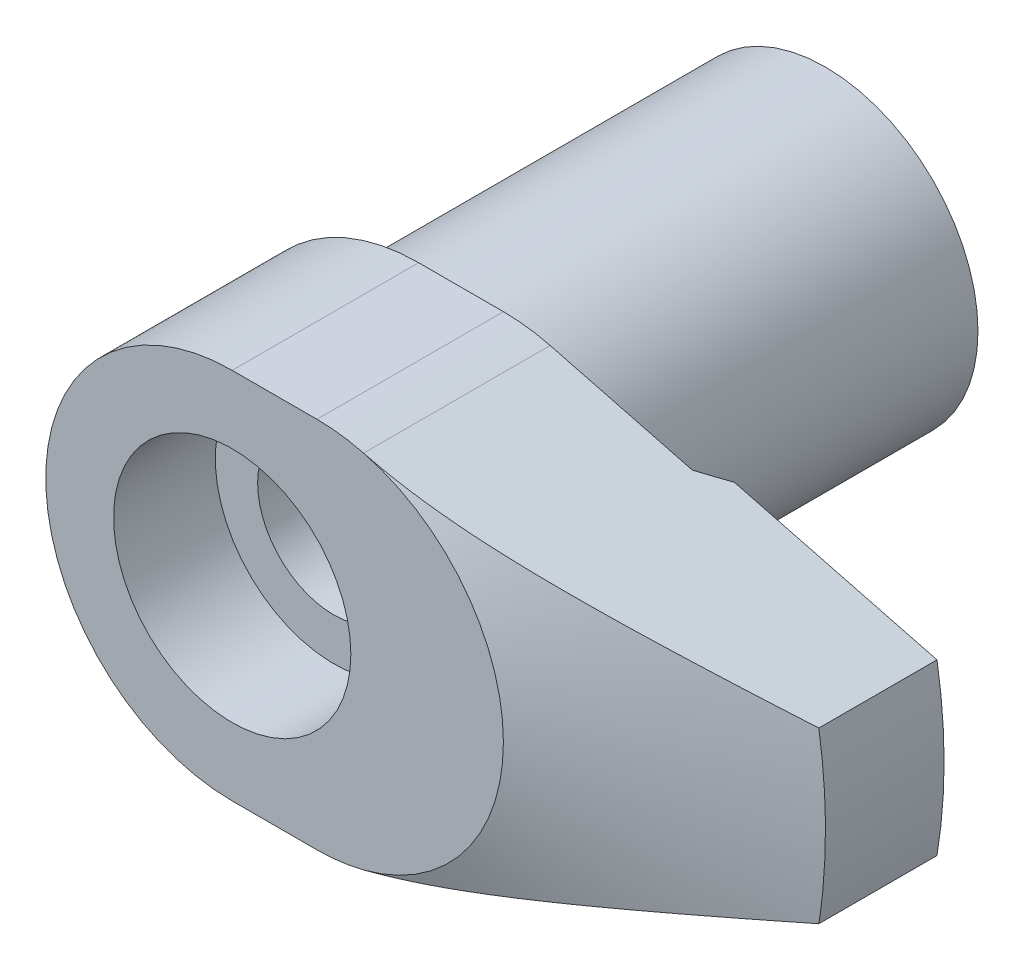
ISO-10303-21;
HEADER;
FILE_DESCRIPTION(('STEP AP214'),'2;1');
FILE_NAME('part.step','',(''),(''),'','','');
FILE_SCHEMA(('AUTOMOTIVE_DESIGN { 1 0 10303 214 1 1 1 1 }'));
ENDSEC;
DATA;
#1=APPLICATION_CONTEXT('core data for automotive mechanical design processes');
#2=APPLICATION_PROTOCOL_DEFINITION('international standard','automotive_design',2000,#1);
#3=PRODUCT_CONTEXT('',#1,'mechanical');
#4=PRODUCT('Part','Part','',(#3));
#5=PRODUCT_RELATED_PRODUCT_CATEGORY('part','',(#4));
#6=PRODUCT_DEFINITION_FORMATION('','',#4);
#7=PRODUCT_DEFINITION_CONTEXT('part definition',#1,'design');
#8=PRODUCT_DEFINITION('design','',#6,#7);
#9=PRODUCT_DEFINITION_SHAPE('','',#8);
#10=(LENGTH_UNIT() NAMED_UNIT(*) SI_UNIT(.MILLI.,.METRE.));
#11=(NAMED_UNIT(*) PLANE_ANGLE_UNIT() SI_UNIT($,.RADIAN.));
#12=(NAMED_UNIT(*) SI_UNIT($,.STERADIAN.) SOLID_ANGLE_UNIT());
#13=UNCERTAINTY_MEASURE_WITH_UNIT(LENGTH_MEASURE(1.E-05),#10,'distance_accuracy_value','');
#14=(GEOMETRIC_REPRESENTATION_CONTEXT(3) GLOBAL_UNCERTAINTY_ASSIGNED_CONTEXT((#13)) GLOBAL_UNIT_ASSIGNED_CONTEXT((#10,
#11,#12)) REPRESENTATION_CONTEXT('',''));
#15=CARTESIAN_POINT('',(0.,0.,0.));
#16=DIRECTION('',(0.,0.,1.));
#17=DIRECTION('',(1.,0.,0.));
#18=AXIS2_PLACEMENT_3D('',#15,#16,#17);
#19=CARTESIAN_POINT('',(29.5803989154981,5.,23.));
#20=DIRECTION('',(0.250587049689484,0.968094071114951,0.));
#21=DIRECTION('',(-0.968094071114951,0.250587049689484,0.));
#22=AXIS2_PLACEMENT_3D('',#19,#20,#21);
#23=PLANE('',#22);
#24=CARTESIAN_POINT('',(27.4352162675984,5.55527144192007,14.8872336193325));
#25=CARTESIAN_POINT('',(27.1469393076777,5.62989071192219,15.1491153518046));
#26=CARTESIAN_POINT('',(26.8580444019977,5.70466993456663,15.4102731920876));
#27=CARTESIAN_POINT('',(26.2788498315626,5.85459199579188,15.9309294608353));
#28=CARTESIAN_POINT('',(25.9885501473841,5.92973483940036,16.1904278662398));
#29=CARTESIAN_POINT('',(25.40625994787,6.08045819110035,16.7076575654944));
#30=CARTESIAN_POINT('',(25.1142687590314,6.15603887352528,16.9653880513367));
#31=CARTESIAN_POINT('',(24.5285196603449,6.30765754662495,17.4786929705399));
#32=CARTESIAN_POINT('',(24.234761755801,6.38369553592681,17.734267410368));
#33=CARTESIAN_POINT('',(23.3389665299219,6.61556833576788,18.5072735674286));
#34=CARTESIAN_POINT('',(22.7337827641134,6.77221759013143,19.0208431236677));
#35=CARTESIAN_POINT('',(21.8180133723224,7.00926061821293,19.7807704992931));
#36=CARTESIAN_POINT('',(21.5114579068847,7.08861120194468,20.0323153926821));
#37=CARTESIAN_POINT('',(20.8952465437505,7.24811490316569,20.5313161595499));
#38=CARTESIAN_POINT('',(20.5855907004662,7.32826800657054,20.7787721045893));
#39=CARTESIAN_POINT('',(19.9624238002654,7.48957211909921,21.2690618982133));
#40=CARTESIAN_POINT('',(19.6489095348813,7.57072395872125,21.5118914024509));
#41=CARTESIAN_POINT('',(19.0177283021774,7.73410254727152,21.9917420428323));
#42=CARTESIAN_POINT('',(18.7000612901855,7.81632930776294,22.2287631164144));
#43=CARTESIAN_POINT('',(18.059644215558,7.98209855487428,22.695970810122));
#44=CARTESIAN_POINT('',(17.7368901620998,8.06564207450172,22.9261516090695));
#45=CARTESIAN_POINT('',(17.0857762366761,8.23418015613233,23.3779063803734));
#46=CARTESIAN_POINT('',(16.7574164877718,8.31917468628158,23.5994805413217));
#47=CARTESIAN_POINT('',(16.0961063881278,8.49035200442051,24.0307522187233));
#48=CARTESIAN_POINT('',(15.7631938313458,8.57652500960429,24.2405113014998));
#49=CARTESIAN_POINT('',(15.0898925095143,8.75080620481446,24.6469894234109));
#50=CARTESIAN_POINT('',(14.7495028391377,8.83891462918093,24.8437068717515));
#51=CARTESIAN_POINT('',(14.0607320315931,9.01720003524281,25.2204922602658));
#52=CARTESIAN_POINT('',(13.7123625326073,9.10737400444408,25.4005827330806));
#53=CARTESIAN_POINT('',(13.0063877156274,9.29011259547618,25.7401308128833));
#54=CARTESIAN_POINT('',(12.6487859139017,9.38267630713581,25.8995961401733));
#55=CARTESIAN_POINT('',(11.9176536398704,9.57192679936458,26.1952138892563));
#56=CARTESIAN_POINT('',(11.5439568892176,9.66865662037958,26.3309325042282));
#57=CARTESIAN_POINT('',(10.7866333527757,9.86468660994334,26.5693931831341));
#58=CARTESIAN_POINT('',(10.4030079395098,9.96398642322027,26.6721397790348));
#59=CARTESIAN_POINT('',(9.82318396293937,10.1140714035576,26.7964437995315));
#60=CARTESIAN_POINT('',(9.62990718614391,10.1641002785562,26.832828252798));
#61=CARTESIAN_POINT('',(9.24180831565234,10.2645580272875,26.8952742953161));
#62=CARTESIAN_POINT('',(9.04698647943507,10.3149868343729,26.9213375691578));
#63=CARTESIAN_POINT('',(8.65628411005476,10.4161184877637,26.9626251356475));
#64=CARTESIAN_POINT('',(8.46040367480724,10.4668213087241,26.9778504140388));
#65=CARTESIAN_POINT('',(8.06812506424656,10.5683609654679,26.9971505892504));
#66=CARTESIAN_POINT('',(7.87172688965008,10.6191978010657,27.0012255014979));
#67=CARTESIAN_POINT('',(7.47834221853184,10.7210237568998,26.9981314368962));
#68=CARTESIAN_POINT('',(7.28135600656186,10.772012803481,26.9909239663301));
#69=CARTESIAN_POINT('',(6.88806770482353,10.8738138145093,26.9653489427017));
#70=CARTESIAN_POINT('',(6.69176561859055,10.9246257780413,26.9469813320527));
#71=CARTESIAN_POINT('',(6.30036520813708,11.0259381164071,26.8994613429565));
#72=CARTESIAN_POINT('',(6.10526705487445,11.0764384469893,26.8703074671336));
#73=CARTESIAN_POINT('',(5.71674773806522,11.177005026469,26.8017843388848));
#74=CARTESIAN_POINT('',(5.52332685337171,11.2270712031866,26.7624134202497));
#75=CARTESIAN_POINT('',(4.94179129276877,11.3775992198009,26.6289953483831));
#76=CARTESIAN_POINT('',(4.55679436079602,11.4772540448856,26.5202003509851));
#77=CARTESIAN_POINT('',(3.79703012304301,11.6739157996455,26.2701775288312));
#78=CARTESIAN_POINT('',(3.42226333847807,11.7709225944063,26.1289480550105));
#79=CARTESIAN_POINT('',(2.7532517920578,11.9440933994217,25.84972275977));
#80=CARTESIAN_POINT('',(2.45723011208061,12.0207173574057,25.7162053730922));
#81=CARTESIAN_POINT('',(1.87162827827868,12.1722979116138,25.4349750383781));
#82=CARTESIAN_POINT('',(1.58204774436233,12.247254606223,25.2872629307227));
#83=CARTESIAN_POINT('',(1.01474960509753,12.3940973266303,24.9833062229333));
#84=CARTESIAN_POINT('',(0.736910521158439,12.466014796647,24.827301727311));
#85=CARTESIAN_POINT('',(0.186515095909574,12.6084823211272,24.5059660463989));
#86=CARTESIAN_POINT('',(-0.086043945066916,12.679033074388,24.3406398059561));
#87=CARTESIAN_POINT('',(-0.356308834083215,12.7489899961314,24.171522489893));
#88=B_SPLINE_CURVE_WITH_KNOTS('',3,(#24,#25,#26,#27,#28,#29,#30,#31,#32,#33,#34,#35,#36,#37,#38,
#39,#40,#41,#42,#43,#44,#45,#46,#47,#48,#49,#50,#51,#52,#53,#54,#55,#56,#57,#58,#59,#60,#61,#62,
#63,#64,#65,#66,#67,#68,#69,#70,#71,#72,#73,#74,#75,#76,#77,#78,#79,#80,#81,#82,#83,#84,#85,#86,
#87),.UNSPECIFIED.,.F.,.F.,(4,2,2,2,2,2,2,2,2,2,2,2,2,2,2,2,2,2,2,2,2,2,2,2,2,2,2,2,2,2,2,4),
(0.,1.1896572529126,2.37933100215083,3.56951641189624,4.75969825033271,7.18662885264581,
8.39983408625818,9.61301806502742,10.8272900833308,12.0415751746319,13.2568656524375,
14.4721294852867,15.6803270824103,16.8886717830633,18.0953541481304,19.3015835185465,
20.5279572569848,21.7541623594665,22.3627422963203,22.9712228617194,23.5796480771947,
24.1880724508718,24.7985772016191,25.4090851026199,26.0196777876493,26.6303701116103,
27.8654022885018,29.1004972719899,30.1010602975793,31.1015641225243,32.0813446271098,
33.0606101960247),.UNSPECIFIED.);
#89=CARTESIAN_POINT('',(17.6291186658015,8.09353826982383,23.));
#90=VERTEX_POINT('',#89);
#91=CARTESIAN_POINT('',(16.1403981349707,8.47888727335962,24.));
#92=VERTEX_POINT('',#91);
#93=EDGE_CURVE('E172',#90,#92,#88,.T.);
#94=ORIENTED_EDGE('',*,*,#93,.T.);
#95=DIRECTION('',(0.968094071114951,-0.250587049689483,0.));
#96=VECTOR('',#95,1.);
#97=CARTESIAN_POINT('',(7.75645754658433,10.6490347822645,24.));
#98=LINE('',#97,#96);
#99=CARTESIAN_POINT('',(7.75645754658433,10.6490347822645,24.));
#100=VERTEX_POINT('',#99);
#101=EDGE_CURVE('E272',#100,#92,#98,.T.);
#102=ORIENTED_EDGE('',*,*,#101,.F.);
#103=DIRECTION('',(0.,0.,1.));
#104=VECTOR('',#103,1.);
#105=CARTESIAN_POINT('',(7.75645754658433,10.6490347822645,23.));
#106=LINE('',#105,#104);
#107=CARTESIAN_POINT('',(7.75645754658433,10.6490347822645,35.));
#108=VERTEX_POINT('',#107);
#109=EDGE_CURVE('E247',#100,#108,#106,.T.);
#110=ORIENTED_EDGE('',*,*,#109,.T.);
#111=CARTESIAN_POINT('',(29.5805989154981,4.99994823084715,29.9700123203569));
#112=CARTESIAN_POINT('',(29.1357626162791,5.11509222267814,30.1174860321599));
#113=CARTESIAN_POINT('',(28.6906869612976,5.23029817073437,30.2641938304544));
#114=CARTESIAN_POINT('',(27.7999660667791,5.46085750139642,30.5557686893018));
#115=CARTESIAN_POINT('',(27.3543208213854,5.57621088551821,30.7006357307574));
#116=CARTESIAN_POINT('',(26.4624675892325,5.80706331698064,30.9881885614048));
#117=CARTESIAN_POINT('',(26.0162597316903,5.92256233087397,31.1308747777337));
#118=CARTESIAN_POINT('',(25.1230866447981,6.15375640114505,31.4136944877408));
#119=CARTESIAN_POINT('',(24.6761214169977,6.26945145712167,31.5538279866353));
#120=CARTESIAN_POINT('',(23.7834718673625,6.50051001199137,31.8303799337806));
#121=CARTESIAN_POINT('',(23.3377918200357,6.61587240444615,31.9668130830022));
#122=CARTESIAN_POINT('',(22.4454084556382,6.84686205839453,32.2360589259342));
#123=CARTESIAN_POINT('',(21.9987051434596,6.96248931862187,32.3688716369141));
#124=CARTESIAN_POINT('',(21.103931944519,7.19409757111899,32.6301684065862));
#125=CARTESIAN_POINT('',(20.6558616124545,7.31007867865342,32.7586508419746));
#126=CARTESIAN_POINT('',(19.7583140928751,7.54240505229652,33.0102832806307));
#127=CARTESIAN_POINT('',(19.3088369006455,7.65875031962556,33.1334332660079));
#128=CARTESIAN_POINT('',(18.4054157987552,7.89259704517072,33.3739579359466));
#129=CARTESIAN_POINT('',(17.9514615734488,8.01010117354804,33.4912914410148));
#130=CARTESIAN_POINT('',(17.0416464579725,8.24560296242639,33.7178219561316));
#131=CARTESIAN_POINT('',(16.5857855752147,8.36360062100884,33.8270189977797));
#132=CARTESIAN_POINT('',(15.672322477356,8.60004667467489,34.0352992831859));
#133=CARTESIAN_POINT('',(15.2147222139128,8.71849456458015,34.1343915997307));
#134=CARTESIAN_POINT('',(14.297156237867,8.9560026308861,34.3203168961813));
#135=CARTESIAN_POINT('',(13.8371904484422,9.0750628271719,34.4071494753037));
#136=CARTESIAN_POINT('',(12.9125012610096,9.31441470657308,34.5663560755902));
#137=CARTESIAN_POINT('',(12.4477655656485,9.43470957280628,34.638654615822));
#138=CARTESIAN_POINT('',(11.5160403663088,9.67588269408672,34.7654169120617));
#139=CARTESIAN_POINT('',(11.0490512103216,9.79676085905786,34.8198833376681));
#140=CARTESIAN_POINT('',(10.3464754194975,9.978619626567,34.8863416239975));
#141=CARTESIAN_POINT('',(10.111552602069,10.0394284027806,34.9059735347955));
#142=CARTESIAN_POINT('',(9.64134067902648,10.1611407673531,34.939841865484));
#143=CARTESIAN_POINT('',(9.40605157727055,10.2220443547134,34.9540783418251));
#144=CARTESIAN_POINT('',(8.93508346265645,10.3439524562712,34.9769487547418));
#145=CARTESIAN_POINT('',(8.69940430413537,10.4049570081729,34.9855794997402));
#146=CARTESIAN_POINT('',(8.2279035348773,10.5270029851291,34.9971137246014));
#147=CARTESIAN_POINT('',(7.99208191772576,10.5880444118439,35.0000169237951));
#148=CARTESIAN_POINT('',(7.75625754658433,10.6490865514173,34.9999999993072));
#149=B_SPLINE_CURVE_WITH_KNOTS('',3,(#111,#112,#113,#114,#115,#116,#117,#118,#119,#120,#121,
#122,#123,#124,#125,#126,#127,#128,#129,#130,#131,#132,#133,#134,#135,#136,#137,#138,#139,#140,
#141,#142,#143,#144,#145,#146,#147,#148),.UNSPECIFIED.,.F.,.F.,(4,2,2,2,2,2,2,2,2,2,2,2,2,2,2,2,
2,2,4),(0.,1.44774916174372,2.89551333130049,4.34299021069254,5.79046413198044,7.23093053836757,
8.67139007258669,10.1123837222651,11.5533822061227,13.0034407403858,14.4534936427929,
15.9022328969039,17.3510195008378,18.8071461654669,20.2630547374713,20.9933787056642,
21.7236950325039,22.4544267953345,23.1851943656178),.UNSPECIFIED.);
#150=CARTESIAN_POINT('',(29.5803989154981,5.,29.9700786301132));
#151=VERTEX_POINT('',#150);
#152=EDGE_CURVE('E163',#151,#108,#149,.T.);
#153=ORIENTED_EDGE('',*,*,#152,.F.);
#154=DIRECTION('',(0.,0.,1.));
#155=VECTOR('',#154,1.);
#156=CARTESIAN_POINT('',(29.5803989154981,5.,23.));
#157=LINE('',#156,#155);
#158=CARTESIAN_POINT('',(29.5803989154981,5.,23.));
#159=VERTEX_POINT('',#158);
#160=EDGE_CURVE('E43',#159,#151,#157,.T.);
#161=ORIENTED_EDGE('',*,*,#160,.F.);
#162=DIRECTION('',(-0.968094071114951,0.250587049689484,0.));
#163=VECTOR('',#162,1.);
#164=CARTESIAN_POINT('',(29.5803989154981,5.,23.));
#165=LINE('',#164,#163);
#166=EDGE_CURVE('E234',#159,#90,#165,.T.);
#167=ORIENTED_EDGE('',*,*,#166,.T.);
#168=EDGE_LOOP('',(#94,#102,#110,#153,#161,#167));
#169=FACE_BOUND('',#168,.T.);
#170=ADVANCED_FACE('F14',(#169),#23,.T.);
#171=CARTESIAN_POINT('',(29.5803989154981,-5.,23.));
#172=DIRECTION('',(0.250587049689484,-0.968094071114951,0.));
#173=DIRECTION('',(0.968094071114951,0.250587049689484,0.));
#174=AXIS2_PLACEMENT_3D('',#171,#172,#173);
#175=PLANE('',#174);
#176=DIRECTION('',(0.,0.,1.));
#177=VECTOR('',#176,1.);
#178=CARTESIAN_POINT('',(7.75645754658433,-10.6490347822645,23.));
#179=LINE('',#178,#177);
#180=CARTESIAN_POINT('',(7.75645754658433,-10.6490347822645,24.));
#181=VERTEX_POINT('',#180);
#182=CARTESIAN_POINT('',(7.75645754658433,-10.6490347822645,35.));
#183=VERTEX_POINT('',#182);
#184=EDGE_CURVE('E235',#181,#183,#179,.T.);
#185=ORIENTED_EDGE('',*,*,#184,.F.);
#186=DIRECTION('',(-0.968094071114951,-0.250587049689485,0.));
#187=VECTOR('',#186,1.);
#188=CARTESIAN_POINT('',(16.1403981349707,-8.47888727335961,24.));
#189=LINE('',#188,#187);
#190=CARTESIAN_POINT('',(16.1403981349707,-8.47888727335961,24.));
#191=VERTEX_POINT('',#190);
#192=EDGE_CURVE('E283',#191,#181,#189,.T.);
#193=ORIENTED_EDGE('',*,*,#192,.F.);
#194=CARTESIAN_POINT('',(-0.356308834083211,-12.7489899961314,24.171522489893));
#195=CARTESIAN_POINT('',(-0.159761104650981,-12.6981144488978,24.2945403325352));
#196=CARTESIAN_POINT('',(0.0379983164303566,-12.6469252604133,24.4155205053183));
#197=CARTESIAN_POINT('',(0.436199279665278,-12.5438526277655,24.6527843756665));
#198=CARTESIAN_POINT('',(0.636641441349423,-12.4919690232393,24.7690669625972));
#199=CARTESIAN_POINT('',(1.04115426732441,-12.3872625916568,24.9966949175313));
#200=CARTESIAN_POINT('',(1.24523595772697,-12.3344369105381,25.1080194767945));
#201=CARTESIAN_POINT('',(1.65644867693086,-12.2279962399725,25.3244385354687));
#202=CARTESIAN_POINT('',(1.86357952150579,-12.1743812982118,25.4295334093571));
#203=CARTESIAN_POINT('',(2.4982796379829,-12.010091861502,25.7382708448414));
#204=CARTESIAN_POINT('',(2.93106166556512,-11.8980680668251,25.9307264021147));
#205=CARTESIAN_POINT('',(3.81057680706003,-11.6704092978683,26.2766267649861));
#206=CARTESIAN_POINT('',(4.25728771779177,-11.5547800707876,26.4301304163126));
#207=CARTESIAN_POINT('',(5.02089611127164,-11.3571232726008,26.6470390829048));
#208=CARTESIAN_POINT('',(5.33428496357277,-11.2760038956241,26.7235904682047));
#209=CARTESIAN_POINT('',(5.9661252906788,-11.1124547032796,26.85021624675));
#210=CARTESIAN_POINT('',(6.28457678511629,-11.03002488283,26.9002905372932));
#211=CARTESIAN_POINT('',(6.92169076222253,-10.8651106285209,26.9710605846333));
#212=CARTESIAN_POINT('',(7.24032600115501,-10.7826332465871,26.9920145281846));
#213=CARTESIAN_POINT('',(7.87812931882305,-10.6175405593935,27.0042125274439));
#214=CARTESIAN_POINT('',(8.19729738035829,-10.5349252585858,26.9954575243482));
#215=CARTESIAN_POINT('',(8.83369537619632,-10.3701963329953,26.9487276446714));
#216=CARTESIAN_POINT('',(9.150924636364,-10.2880828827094,26.9107431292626));
#217=CARTESIAN_POINT('',(9.78117559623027,-10.1249450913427,26.8075575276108));
#218=CARTESIAN_POINT('',(10.0941968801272,-10.0439208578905,26.7423537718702));
#219=CARTESIAN_POINT('',(10.7160969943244,-9.88294464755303,26.5873480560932));
#220=CARTESIAN_POINT('',(11.0249465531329,-9.80300024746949,26.4974223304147));
#221=CARTESIAN_POINT('',(11.636081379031,-9.64481058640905,26.2965660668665));
#222=CARTESIAN_POINT('',(11.9383669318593,-9.5665652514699,26.1856364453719));
#223=CARTESIAN_POINT('',(12.6350607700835,-9.38622900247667,25.9065344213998));
#224=CARTESIAN_POINT('',(13.0269036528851,-9.28480213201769,25.7315591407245));
#225=CARTESIAN_POINT('',(13.7995718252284,-9.08480024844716,25.3571468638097));
#226=CARTESIAN_POINT('',(14.1803909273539,-8.98622683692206,25.1576964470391));
#227=CARTESIAN_POINT('',(14.9328451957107,-8.79145723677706,24.7393947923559));
#228=CARTESIAN_POINT('',(15.3044597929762,-8.69526637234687,24.5205043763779));
#229=CARTESIAN_POINT('',(16.0389739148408,-8.50514050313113,24.0678893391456));
#230=CARTESIAN_POINT('',(16.4018749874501,-8.41120509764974,23.8341673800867));
#231=CARTESIAN_POINT('',(17.123155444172,-8.22450470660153,23.3530942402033));
#232=CARTESIAN_POINT('',(17.4814762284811,-8.13175488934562,23.1056497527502));
#233=CARTESIAN_POINT('',(18.1917862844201,-7.94789414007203,22.6012566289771));
#234=CARTESIAN_POINT('',(18.543775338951,-7.85678326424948,22.3443076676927));
#235=CARTESIAN_POINT('',(19.2419848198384,-7.67605469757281,21.8230436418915));
#236=CARTESIAN_POINT('',(19.5882113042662,-7.58643543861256,21.5587372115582));
#237=CARTESIAN_POINT('',(20.2760952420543,-7.40837959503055,21.0238828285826));
#238=CARTESIAN_POINT('',(20.617752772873,-7.31994299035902,20.7533349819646));
#239=CARTESIAN_POINT('',(21.517964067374,-7.08692710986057,20.0296038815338));
#240=CARTESIAN_POINT('',(22.0731795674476,-6.9432119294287,19.5719921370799));
#241=CARTESIAN_POINT('',(23.1755337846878,-6.65787220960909,18.6462492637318));
#242=CARTESIAN_POINT('',(23.7226703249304,-6.51624823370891,18.1781153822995));
#243=CARTESIAN_POINT('',(24.800238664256,-6.23732423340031,17.2427262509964));
#244=CARTESIAN_POINT('',(25.3307912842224,-6.09999293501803,16.7756192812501));
#245=CARTESIAN_POINT('',(26.122735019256,-5.89500165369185,16.0705230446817));
#246=CARTESIAN_POINT('',(26.3860198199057,-5.82685149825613,15.8347962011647));
#247=CARTESIAN_POINT('',(26.9114454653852,-5.69084729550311,15.3619909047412));
#248=CARTESIAN_POINT('',(27.1735863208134,-5.62299324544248,15.124912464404));
#249=CARTESIAN_POINT('',(27.4352162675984,-5.55527144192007,14.8872336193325));
#250=B_SPLINE_CURVE_WITH_KNOTS('',3,(#194,#195,#196,#197,#198,#199,#200,#201,#202,#203,#204,
#205,#206,#207,#208,#209,#210,#211,#212,#213,#214,#215,#216,#217,#218,#219,#220,#221,#222,#223,
#224,#225,#226,#227,#228,#229,#230,#231,#232,#233,#234,#235,#236,#237,#238,#239,#240,#241,#242,
#243,#244,#245,#246,#247,#248,#249),.UNSPECIFIED.,.F.,.F.,(4,2,2,2,2,2,2,2,2,2,2,2,2,2,2,2,2,2,
2,2,2,2,2,2,2,2,2,4),(0.,0.712170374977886,1.42450815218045,2.13959781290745,2.85464444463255,
4.31337521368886,5.76988893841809,6.76688167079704,7.76387827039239,8.75197765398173,
9.74004573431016,10.7284397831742,11.716930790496,12.7104635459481,13.7039529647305,
15.0257282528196,16.3482315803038,17.6734634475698,18.9984581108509,20.3339498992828,
21.6694873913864,23.0035186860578,24.3375273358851,26.5384684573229,28.7399921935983,
30.9002141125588,31.979921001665,33.0596178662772),.UNSPECIFIED.);
#251=CARTESIAN_POINT('',(17.6291186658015,-8.09353826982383,23.));
#252=VERTEX_POINT('',#251);
#253=EDGE_CURVE('E9',#191,#252,#250,.T.);
#254=ORIENTED_EDGE('',*,*,#253,.T.);
#255=DIRECTION('',(0.968094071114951,0.250587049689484,0.));
#256=VECTOR('',#255,1.);
#257=CARTESIAN_POINT('',(29.5803989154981,-5.,23.));
#258=LINE('',#257,#256);
#259=CARTESIAN_POINT('',(29.5803989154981,-5.,23.));
#260=VERTEX_POINT('',#259);
#261=EDGE_CURVE('E91',#252,#260,#258,.T.);
#262=ORIENTED_EDGE('',*,*,#261,.T.);
#263=DIRECTION('',(0.,0.,1.));
#264=VECTOR('',#263,1.);
#265=CARTESIAN_POINT('',(29.5803989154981,-5.,23.));
#266=LINE('',#265,#264);
#267=CARTESIAN_POINT('',(29.5803989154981,-5.,29.9700786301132));
#268=VERTEX_POINT('',#267);
#269=EDGE_CURVE('E251',#260,#268,#266,.T.);
#270=ORIENTED_EDGE('',*,*,#269,.T.);
#271=CARTESIAN_POINT('',(7.75625754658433,-10.6490865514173,34.9999999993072));
#272=CARTESIAN_POINT('',(7.98917423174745,-10.5887970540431,35.0000161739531));
#273=CARTESIAN_POINT('',(8.22208831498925,-10.5285082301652,34.997184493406));
#274=CARTESIAN_POINT('',(8.68777942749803,-10.4079660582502,34.985932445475));
#275=CARTESIAN_POINT('',(8.92055646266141,-10.3477127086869,34.9775123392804));
#276=CARTESIAN_POINT('',(9.38573625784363,-10.2273028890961,34.9551965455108));
#277=CARTESIAN_POINT('',(9.61813915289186,-10.1671463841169,34.9413038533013));
#278=CARTESIAN_POINT('',(10.0825912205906,-10.0469249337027,34.90824655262));
#279=CARTESIAN_POINT('',(10.3146403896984,-9.98685998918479,34.8890818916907));
#280=CARTESIAN_POINT('',(11.0086634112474,-9.80721506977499,34.8241869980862));
#281=CARTESIAN_POINT('',(11.4699954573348,-9.68780122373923,34.7709816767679));
#282=CARTESIAN_POINT('',(12.3904710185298,-9.44954002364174,34.6470760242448));
#283=CARTESIAN_POINT('',(12.8496142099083,-9.33069275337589,34.5763731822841));
#284=CARTESIAN_POINT('',(13.7632169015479,-9.09421056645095,34.4205799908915));
#285=CARTESIAN_POINT('',(14.2176883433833,-8.97657255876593,34.3355636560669));
#286=CARTESIAN_POINT('',(15.1243152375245,-8.74189602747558,34.1534202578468));
#287=CARTESIAN_POINT('',(15.5764707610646,-8.62485748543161,34.0562935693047));
#288=CARTESIAN_POINT('',(16.4790686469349,-8.39122384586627,33.8520399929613));
#289=CARTESIAN_POINT('',(16.9295091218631,-8.27462923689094,33.7449042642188));
#290=CARTESIAN_POINT('',(17.8285084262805,-8.04192707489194,33.522549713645));
#291=CARTESIAN_POINT('',(18.2770672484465,-7.92581952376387,33.4073308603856));
#292=CARTESIAN_POINT('',(19.1807959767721,-7.69189317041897,33.1681266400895));
#293=CARTESIAN_POINT('',(19.6359353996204,-7.57408225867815,33.0440188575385));
#294=CARTESIAN_POINT('',(20.544753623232,-7.33883851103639,32.7902440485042));
#295=CARTESIAN_POINT('',(20.9984324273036,-7.22140567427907,32.6605770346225));
#296=CARTESIAN_POINT('',(21.9043813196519,-6.98690464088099,32.3967370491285));
#297=CARTESIAN_POINT('',(22.3566518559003,-6.86983632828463,32.2625657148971));
#298=CARTESIAN_POINT('',(23.2601341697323,-6.63597375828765,31.9904700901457));
#299=CARTESIAN_POINT('',(23.7113459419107,-6.51917950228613,31.8525457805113));
#300=CARTESIAN_POINT('',(24.6151130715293,-6.2852432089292,31.5728846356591));
#301=CARTESIAN_POINT('',(25.067663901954,-6.16810234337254,31.4311322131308));
#302=CARTESIAN_POINT('',(25.9719849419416,-5.93402267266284,31.1449941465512));
#303=CARTESIAN_POINT('',(26.4237551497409,-5.81708386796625,31.00060849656));
#304=CARTESIAN_POINT('',(27.3267044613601,-5.58335926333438,30.7095973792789));
#305=CARTESIAN_POINT('',(27.7778834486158,-5.46657349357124,30.562971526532));
#306=CARTESIAN_POINT('',(28.67965632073,-5.2331534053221,30.2678293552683));
#307=CARTESIAN_POINT('',(29.1302502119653,-5.1165190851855,30.1193130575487));
#308=CARTESIAN_POINT('',(29.5805989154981,-4.99994823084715,29.9700123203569));
#309=B_SPLINE_CURVE_WITH_KNOTS('',3,(#271,#272,#273,#274,#275,#276,#277,#278,#279,#280,#281,
#282,#283,#284,#285,#286,#287,#288,#289,#290,#291,#292,#293,#294,#295,#296,#297,#298,#299,#300,
#301,#302,#303,#304,#305,#306,#307,#308),.UNSPECIFIED.,.F.,.F.,(4,2,2,2,2,2,2,2,2,2,2,2,2,2,2,2,
2,2,4),(0.,0.721757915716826,1.44348210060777,2.16481180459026,2.88614868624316,
4.32422625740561,5.76251030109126,7.19357343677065,8.62459228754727,10.0568873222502,
11.4891879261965,12.9478809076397,14.4065705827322,15.864735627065,17.3229080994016,
18.788355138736,20.2538054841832,21.7195108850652,23.1852001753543),.UNSPECIFIED.);
#310=EDGE_CURVE('E198',#183,#268,#309,.T.);
#311=ORIENTED_EDGE('',*,*,#310,.F.);
#312=EDGE_LOOP('',(#185,#193,#254,#262,#270,#311));
#313=FACE_BOUND('',#312,.T.);
#314=ADVANCED_FACE('F146',(#313),#175,.T.);
#315=CARTESIAN_POINT('',(0.,11.,23.));
#316=DIRECTION('',(0.,1.,0.));
#317=DIRECTION('',(-1.,0.,0.));
#318=AXIS2_PLACEMENT_3D('',#315,#316,#317);
#319=PLANE('',#318);
#320=DIRECTION('',(0.,0.,1.));
#321=VECTOR('',#320,1.);
#322=CARTESIAN_POINT('',(5.,11.,23.));
#323=LINE('',#322,#321);
#324=CARTESIAN_POINT('',(5.,11.,24.));
#325=VERTEX_POINT('',#324);
#326=CARTESIAN_POINT('',(5.,11.,35.));
#327=VERTEX_POINT('',#326);
#328=EDGE_CURVE('E80',#325,#327,#323,.T.);
#329=ORIENTED_EDGE('',*,*,#328,.F.);
#330=DIRECTION('',(1.,0.,0.));
#331=VECTOR('',#330,1.);
#332=CARTESIAN_POINT('',(0.,11.,24.));
#333=LINE('',#332,#331);
#334=CARTESIAN_POINT('',(0.,11.,24.));
#335=VERTEX_POINT('',#334);
#336=EDGE_CURVE('E74',#335,#325,#333,.T.);
#337=ORIENTED_EDGE('',*,*,#336,.F.);
#338=DIRECTION('',(0.,0.,1.));
#339=VECTOR('',#338,1.);
#340=CARTESIAN_POINT('',(0.,11.,23.));
#341=LINE('',#340,#339);
#342=CARTESIAN_POINT('',(0.,11.,35.));
#343=VERTEX_POINT('',#342);
#344=EDGE_CURVE('E67',#335,#343,#341,.T.);
#345=ORIENTED_EDGE('',*,*,#344,.T.);
#346=DIRECTION('',(-1.,0.,0.));
#347=VECTOR('',#346,1.);
#348=CARTESIAN_POINT('',(0.,11.,35.));
#349=LINE('',#348,#347);
#350=EDGE_CURVE('E71',#327,#343,#349,.T.);
#351=ORIENTED_EDGE('',*,*,#350,.F.);
#352=EDGE_LOOP('',(#329,#337,#345,#351));
#353=FACE_BOUND('',#352,.T.);
#354=ADVANCED_FACE('F70',(#353),#319,.T.);
#355=CARTESIAN_POINT('',(5.,0.,23.));
#356=DIRECTION('',(0.,0.,1.));
#357=DIRECTION('',(1.,0.,0.));
#358=AXIS2_PLACEMENT_3D('',#355,#356,#357);
#359=CYLINDRICAL_SURFACE('',#358,11.);
#360=ORIENTED_EDGE('',*,*,#109,.F.);
#361=CARTESIAN_POINT('',(5.,0.,24.));
#362=DIRECTION('',(0.,0.,-1.));
#363=DIRECTION('',(-1.,0.,0.));
#364=AXIS2_PLACEMENT_3D('',#361,#362,#363);
#365=CIRCLE('',#364,11.);
#366=EDGE_CURVE('E275',#325,#100,#365,.T.);
#367=ORIENTED_EDGE('',*,*,#366,.F.);
#368=ORIENTED_EDGE('',*,*,#328,.T.);
#369=CARTESIAN_POINT('',(5.,0.,35.));
#370=DIRECTION('',(0.,0.,1.));
#371=DIRECTION('',(1.,0.,0.));
#372=AXIS2_PLACEMENT_3D('',#369,#370,#371);
#373=CIRCLE('',#372,11.);
#374=EDGE_CURVE('E90',#108,#327,#373,.T.);
#375=ORIENTED_EDGE('',*,*,#374,.F.);
#376=EDGE_LOOP('',(#360,#367,#368,#375));
#377=FACE_BOUND('',#376,.T.);
#378=ADVANCED_FACE('F157',(#377),#359,.T.);
#379=CARTESIAN_POINT('',(5.,0.,23.));
#380=DIRECTION('',(0.,0.,1.));
#381=DIRECTION('',(1.,0.,0.));
#382=AXIS2_PLACEMENT_3D('',#379,#380,#381);
#383=CYLINDRICAL_SURFACE('',#382,11.);
#384=DIRECTION('',(0.,0.,1.));
#385=VECTOR('',#384,1.);
#386=CARTESIAN_POINT('',(5.,-11.,23.));
#387=LINE('',#386,#385);
#388=CARTESIAN_POINT('',(5.,-11.,24.));
#389=VERTEX_POINT('',#388);
#390=CARTESIAN_POINT('',(5.,-11.,35.));
#391=VERTEX_POINT('',#390);
#392=EDGE_CURVE('E233',#389,#391,#387,.T.);
#393=ORIENTED_EDGE('',*,*,#392,.F.);
#394=CARTESIAN_POINT('',(5.,0.,24.));
#395=DIRECTION('',(0.,0.,-1.));
#396=DIRECTION('',(-1.,0.,0.));
#397=AXIS2_PLACEMENT_3D('',#394,#395,#396);
#398=CIRCLE('',#397,11.);
#399=EDGE_CURVE('E261',#181,#389,#398,.T.);
#400=ORIENTED_EDGE('',*,*,#399,.F.);
#401=ORIENTED_EDGE('',*,*,#184,.T.);
#402=CARTESIAN_POINT('',(5.,0.,35.));
#403=DIRECTION('',(0.,0.,1.));
#404=DIRECTION('',(1.,0.,0.));
#405=AXIS2_PLACEMENT_3D('',#402,#403,#404);
#406=CIRCLE('',#405,11.);
#407=EDGE_CURVE('E243',#391,#183,#406,.T.);
#408=ORIENTED_EDGE('',*,*,#407,.F.);
#409=EDGE_LOOP('',(#393,#400,#401,#408));
#410=FACE_BOUND('',#409,.T.);
#411=ADVANCED_FACE('F258',(#410),#383,.T.);
#412=CARTESIAN_POINT('',(1.1521895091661E-13,-11.,23.));
#413=DIRECTION('',(0.,-1.,0.));
#414=DIRECTION('',(1.,0.,0.));
#415=AXIS2_PLACEMENT_3D('',#412,#413,#414);
#416=PLANE('',#415);
#417=DIRECTION('',(0.,0.,1.));
#418=VECTOR('',#417,1.);
#419=CARTESIAN_POINT('',(1.1521895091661E-13,-11.,23.));
#420=LINE('',#419,#418);
#421=CARTESIAN_POINT('',(1.19260151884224E-13,-11.,24.));
#422=VERTEX_POINT('',#421);
#423=CARTESIAN_POINT('',(1.1521895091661E-13,-11.,35.));
#424=VERTEX_POINT('',#423);
#425=EDGE_CURVE('E94',#422,#424,#420,.T.);
#426=ORIENTED_EDGE('',*,*,#425,.F.);
#427=DIRECTION('',(-1.,0.,0.));
#428=VECTOR('',#427,1.);
#429=CARTESIAN_POINT('',(5.,-11.,24.));
#430=LINE('',#429,#428);
#431=EDGE_CURVE('E231',#389,#422,#430,.T.);
#432=ORIENTED_EDGE('',*,*,#431,.F.);
#433=ORIENTED_EDGE('',*,*,#392,.T.);
#434=DIRECTION('',(1.,0.,0.));
#435=VECTOR('',#434,1.);
#436=CARTESIAN_POINT('',(1.1521895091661E-13,-11.,35.));
#437=LINE('',#436,#435);
#438=EDGE_CURVE('E213',#424,#391,#437,.T.);
#439=ORIENTED_EDGE('',*,*,#438,.F.);
#440=EDGE_LOOP('',(#426,#432,#433,#439));
#441=FACE_BOUND('',#440,.T.);
#442=ADVANCED_FACE('F230',(#441),#416,.T.);
#443=CARTESIAN_POINT('',(30.,20.,23.));
#444=DIRECTION('',(0.,0.,1.));
#445=DIRECTION('',(1.,0.,0.));
#446=AXIS2_PLACEMENT_3D('',#443,#444,#445);
#447=PLANE('',#446);
#448=CARTESIAN_POINT('',(5.,0.,23.));
#449=DIRECTION('',(0.,0.,-1.));
#450=DIRECTION('',(-1.,0.,0.));
#451=AXIS2_PLACEMENT_3D('',#448,#449,#450);
#452=CIRCLE('',#451,15.);
#453=EDGE_CURVE('E35',#90,#252,#452,.T.);
#454=ORIENTED_EDGE('',*,*,#453,.F.);
#455=ORIENTED_EDGE('',*,*,#166,.F.);
#456=CARTESIAN_POINT('',(0.,0.,23.));
#457=DIRECTION('',(0.,0.,1.));
#458=DIRECTION('',(1.,0.,0.));
#459=AXIS2_PLACEMENT_3D('',#456,#457,#458);
#460=CIRCLE('',#459,30.);
#461=EDGE_CURVE('E236',#260,#159,#460,.T.);
#462=ORIENTED_EDGE('',*,*,#461,.F.);
#463=ORIENTED_EDGE('',*,*,#261,.F.);
#464=EDGE_LOOP('',(#454,#455,#462,#463));
#465=FACE_BOUND('',#464,.T.);
#466=ADVANCED_FACE('F269',(#465),#447,.F.);
#467=CARTESIAN_POINT('',(0.,0.,35.));
#468=DIRECTION('',(0.,0.,-1.));
#469=DIRECTION('',(-1.,0.,0.));
#470=AXIS2_PLACEMENT_3D('',#467,#468,#469);
#471=CYLINDRICAL_SURFACE('',#470,11.);
#472=CARTESIAN_POINT('',(0.,0.,24.));
#473=DIRECTION('',(0.,0.,1.));
#474=DIRECTION('',(1.,0.,0.));
#475=AXIS2_PLACEMENT_3D('',#472,#473,#474);
#476=CIRCLE('',#475,11.);
#477=EDGE_CURVE('E179',#335,#422,#476,.T.);
#478=ORIENTED_EDGE('',*,*,#477,.T.);
#479=ORIENTED_EDGE('',*,*,#425,.T.);
#480=CARTESIAN_POINT('',(0.,0.,35.));
#481=DIRECTION('',(0.,0.,1.));
#482=DIRECTION('',(1.,0.,0.));
#483=AXIS2_PLACEMENT_3D('',#480,#481,#482);
#484=CIRCLE('',#483,11.);
#485=EDGE_CURVE('E28',#343,#424,#484,.T.);
#486=ORIENTED_EDGE('',*,*,#485,.F.);
#487=ORIENTED_EDGE('',*,*,#344,.F.);
#488=EDGE_LOOP('',(#478,#479,#486,#487));
#489=FACE_BOUND('',#488,.T.);
#490=ADVANCED_FACE('F16',(#489),#471,.T.);
#491=CARTESIAN_POINT('',(0.,0.,35.));
#492=DIRECTION('',(0.,0.,-1.));
#493=DIRECTION('',(-1.,0.,0.));
#494=AXIS2_PLACEMENT_3D('',#491,#492,#493);
#495=CYLINDRICAL_SURFACE('',#494,4.5);
#496=CARTESIAN_POINT('',(0.,0.,29.));
#497=DIRECTION('',(0.,0.,1.));
#498=DIRECTION('',(1.,0.,0.));
#499=AXIS2_PLACEMENT_3D('',#496,#497,#498);
#500=CIRCLE('',#499,4.5);
#501=CARTESIAN_POINT('',(4.5,0.,29.));
#502=VERTEX_POINT('',#501);
#503=EDGE_CURVE('E99',#502,#502,#500,.T.);
#504=ORIENTED_EDGE('',*,*,#503,.T.);
#505=EDGE_LOOP('',(#504));
#506=FACE_BOUND('',#505,.T.);
#507=CARTESIAN_POINT('',(0.,0.,10.));
#508=DIRECTION('',(0.,0.,-1.));
#509=DIRECTION('',(-1.,0.,0.));
#510=AXIS2_PLACEMENT_3D('',#507,#508,#509);
#511=CIRCLE('',#510,4.5);
#512=CARTESIAN_POINT('',(-4.5,0.,10.));
#513=VERTEX_POINT('',#512);
#514=EDGE_CURVE('E105',#513,#513,#511,.T.);
#515=ORIENTED_EDGE('',*,*,#514,.T.);
#516=EDGE_LOOP('',(#515));
#517=FACE_BOUND('',#516,.T.);
#518=ADVANCED_FACE('F134',(#506,#517),#495,.F.);
#519=CARTESIAN_POINT('',(0.,0.,35.));
#520=DIRECTION('',(0.,0.,1.));
#521=DIRECTION('',(1.,0.,0.));
#522=AXIS2_PLACEMENT_3D('',#519,#520,#521);
#523=PLANE('',#522);
#524=CARTESIAN_POINT('',(5.,0.,35.));
#525=DIRECTION('',(0.,0.,1.));
#526=DIRECTION('',(1.,0.,0.));
#527=AXIS2_PLACEMENT_3D('',#524,#525,#526);
#528=CIRCLE('',#527,11.);
#529=EDGE_CURVE('E214',#183,#108,#528,.T.);
#530=ORIENTED_EDGE('',*,*,#529,.T.);
#531=ORIENTED_EDGE('',*,*,#374,.T.);
#532=ORIENTED_EDGE('',*,*,#350,.T.);
#533=ORIENTED_EDGE('',*,*,#485,.T.);
#534=ORIENTED_EDGE('',*,*,#438,.T.);
#535=ORIENTED_EDGE('',*,*,#407,.T.);
#536=EDGE_LOOP('',(#530,#531,#532,#533,#534,#535));
#537=FACE_BOUND('',#536,.T.);
#538=CARTESIAN_POINT('',(0.,0.,35.));
#539=DIRECTION('',(0.,0.,1.));
#540=DIRECTION('',(1.,0.,0.));
#541=AXIS2_PLACEMENT_3D('',#538,#539,#540);
#542=CIRCLE('',#541,7.);
#543=CARTESIAN_POINT('',(7.,0.,35.));
#544=VERTEX_POINT('',#543);
#545=EDGE_CURVE('E107',#544,#544,#542,.T.);
#546=ORIENTED_EDGE('',*,*,#545,.F.);
#547=EDGE_LOOP('',(#546));
#548=FACE_BOUND('',#547,.T.);
#549=ADVANCED_FACE('F86',(#537,#548),#523,.T.);
#550=CARTESIAN_POINT('',(0.,0.,0.));
#551=DIRECTION('',(0.,0.,1.));
#552=DIRECTION('',(1.,0.,0.));
#553=AXIS2_PLACEMENT_3D('',#550,#551,#552);
#554=PLANE('',#553);
#555=CARTESIAN_POINT('',(0.,0.,0.));
#556=DIRECTION('',(0.,0.,-1.));
#557=DIRECTION('',(-1.,0.,0.));
#558=AXIS2_PLACEMENT_3D('',#555,#556,#557);
#559=CIRCLE('',#558,5.5);
#560=CARTESIAN_POINT('',(-5.5,0.,0.));
#561=VERTEX_POINT('',#560);
#562=EDGE_CURVE('E79',#561,#561,#559,.T.);
#563=ORIENTED_EDGE('',*,*,#562,.F.);
#564=EDGE_LOOP('',(#563));
#565=FACE_BOUND('',#564,.T.);
#566=CARTESIAN_POINT('',(0.,0.,0.));
#567=DIRECTION('',(0.,0.,-1.));
#568=DIRECTION('',(-1.,0.,0.));
#569=AXIS2_PLACEMENT_3D('',#566,#567,#568);
#570=CIRCLE('',#569,9.);
#571=CARTESIAN_POINT('',(-9.,0.,0.));
#572=VERTEX_POINT('',#571);
#573=EDGE_CURVE('E96',#572,#572,#570,.T.);
#574=ORIENTED_EDGE('',*,*,#573,.T.);
#575=EDGE_LOOP('',(#574));
#576=FACE_BOUND('',#575,.T.);
#577=ADVANCED_FACE('F133',(#565,#576),#554,.F.);
#578=CARTESIAN_POINT('',(0.,0.,23.));
#579=DIRECTION('',(0.,0.,-1.));
#580=DIRECTION('',(-1.,0.,0.));
#581=AXIS2_PLACEMENT_3D('',#578,#579,#580);
#582=CYLINDRICAL_SURFACE('',#581,9.);
#583=ORIENTED_EDGE('',*,*,#573,.F.);
#584=EDGE_LOOP('',(#583));
#585=FACE_BOUND('',#584,.T.);
#586=CARTESIAN_POINT('',(0.,0.,24.));
#587=DIRECTION('',(0.,0.,1.));
#588=DIRECTION('',(1.,0.,0.));
#589=AXIS2_PLACEMENT_3D('',#586,#587,#588);
#590=CIRCLE('',#589,9.);
#591=CARTESIAN_POINT('',(9.,0.,24.));
#592=VERTEX_POINT('',#591);
#593=EDGE_CURVE('E218',#592,#592,#590,.T.);
#594=ORIENTED_EDGE('',*,*,#593,.F.);
#595=EDGE_LOOP('',(#594));
#596=FACE_BOUND('',#595,.T.);
#597=ADVANCED_FACE('F129',(#585,#596),#582,.T.);
#598=CARTESIAN_POINT('',(0.,0.,29.));
#599=DIRECTION('',(0.,0.,1.));
#600=DIRECTION('',(1.,0.,0.));
#601=AXIS2_PLACEMENT_3D('',#598,#599,#600);
#602=CYLINDRICAL_SURFACE('',#601,7.);
#603=CARTESIAN_POINT('',(0.,0.,29.));
#604=DIRECTION('',(0.,0.,1.));
#605=DIRECTION('',(1.,0.,0.));
#606=AXIS2_PLACEMENT_3D('',#603,#604,#605);
#607=CIRCLE('',#606,7.);
#608=CARTESIAN_POINT('',(7.,0.,29.));
#609=VERTEX_POINT('',#608);
#610=EDGE_CURVE('E104',#609,#609,#607,.T.);
#611=ORIENTED_EDGE('',*,*,#610,.F.);
#612=EDGE_LOOP('',(#611));
#613=FACE_BOUND('',#612,.T.);
#614=ORIENTED_EDGE('',*,*,#545,.T.);
#615=EDGE_LOOP('',(#614));
#616=FACE_BOUND('',#615,.T.);
#617=ADVANCED_FACE('F126',(#613,#616),#602,.F.);
#618=CARTESIAN_POINT('',(0.,0.,29.));
#619=DIRECTION('',(0.,0.,1.));
#620=DIRECTION('',(1.,0.,0.));
#621=AXIS2_PLACEMENT_3D('',#618,#619,#620);
#622=PLANE('',#621);
#623=ORIENTED_EDGE('',*,*,#503,.F.);
#624=EDGE_LOOP('',(#623));
#625=FACE_BOUND('',#624,.T.);
#626=ORIENTED_EDGE('',*,*,#610,.T.);
#627=EDGE_LOOP('',(#626));
#628=FACE_BOUND('',#627,.T.);
#629=ADVANCED_FACE('F124',(#625,#628),#622,.T.);
#630=CARTESIAN_POINT('',(0.,0.,10.));
#631=DIRECTION('',(0.,0.,-1.));
#632=DIRECTION('',(-1.,0.,0.));
#633=AXIS2_PLACEMENT_3D('',#630,#631,#632);
#634=CYLINDRICAL_SURFACE('',#633,5.5);
#635=CARTESIAN_POINT('',(0.,0.,10.));
#636=DIRECTION('',(0.,0.,-1.));
#637=DIRECTION('',(-1.,0.,0.));
#638=AXIS2_PLACEMENT_3D('',#635,#636,#637);
#639=CIRCLE('',#638,5.5);
#640=CARTESIAN_POINT('',(-5.5,0.,10.));
#641=VERTEX_POINT('',#640);
#642=EDGE_CURVE('E108',#641,#641,#639,.T.);
#643=ORIENTED_EDGE('',*,*,#642,.F.);
#644=EDGE_LOOP('',(#643));
#645=FACE_BOUND('',#644,.T.);
#646=ORIENTED_EDGE('',*,*,#562,.T.);
#647=EDGE_LOOP('',(#646));
#648=FACE_BOUND('',#647,.T.);
#649=ADVANCED_FACE('F408',(#645,#648),#634,.F.);
#650=CARTESIAN_POINT('',(0.,0.,10.));
#651=DIRECTION('',(0.,0.,-1.));
#652=DIRECTION('',(-1.,0.,0.));
#653=AXIS2_PLACEMENT_3D('',#650,#651,#652);
#654=PLANE('',#653);
#655=ORIENTED_EDGE('',*,*,#514,.F.);
#656=EDGE_LOOP('',(#655));
#657=FACE_BOUND('',#656,.T.);
#658=ORIENTED_EDGE('',*,*,#642,.T.);
#659=EDGE_LOOP('',(#658));
#660=FACE_BOUND('',#659,.T.);
#661=ADVANCED_FACE('F416',(#657,#660),#654,.T.);
#662=CARTESIAN_POINT('',(0.,0.,23.));
#663=DIRECTION('',(0.,0.,1.));
#664=DIRECTION('',(1.,0.,0.));
#665=AXIS2_PLACEMENT_3D('',#662,#663,#664);
#666=CYLINDRICAL_SURFACE('',#665,30.);
#667=CARTESIAN_POINT('',(29.5803651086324,-5.0002,29.9700762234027));
#668=CARTESIAN_POINT('',(29.650388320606,-4.58595813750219,29.9750613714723));
#669=CARTESIAN_POINT('',(29.7117012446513,-4.17028298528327,29.9794301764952));
#670=CARTESIAN_POINT('',(29.8168210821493,-3.33671572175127,29.9869245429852));
#671=CARTESIAN_POINT('',(29.86062807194,-2.91882362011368,29.9900501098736));
#672=CARTESIAN_POINT('',(29.9651578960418,-1.66882854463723,29.9975101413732));
#673=CARTESIAN_POINT('',(30.,-0.834414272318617,30.));
#674=CARTESIAN_POINT('',(30.,0.834414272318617,30.));
#675=CARTESIAN_POINT('',(29.9651578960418,1.66882854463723,29.9975101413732));
#676=CARTESIAN_POINT('',(29.86062807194,2.91882362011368,29.9900501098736));
#677=CARTESIAN_POINT('',(29.8168210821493,3.33671572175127,29.9869245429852));
#678=CARTESIAN_POINT('',(29.7117012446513,4.17028298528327,29.9794301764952));
#679=CARTESIAN_POINT('',(29.650388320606,4.58595813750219,29.9750613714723));
#680=CARTESIAN_POINT('',(29.5803651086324,5.0002,29.9700762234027));
#681=B_SPLINE_CURVE_WITH_KNOTS('',3,(#667,#668,#669,#670,#671,#672,#673,#674,#675,#676,#677,
#678,#679,#680),.UNSPECIFIED.,.F.,.F.,(4,2,2,2,2,2,4),(0.,1.2602595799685,2.52051366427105,
5.02284793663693,7.52518220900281,8.78543629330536,10.0456958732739),.UNSPECIFIED.);
#682=EDGE_CURVE('E204',#268,#151,#681,.T.);
#683=ORIENTED_EDGE('',*,*,#682,.F.);
#684=ORIENTED_EDGE('',*,*,#269,.F.);
#685=ORIENTED_EDGE('',*,*,#461,.T.);
#686=ORIENTED_EDGE('',*,*,#160,.T.);
#687=EDGE_LOOP('',(#683,#684,#685,#686));
#688=FACE_BOUND('',#687,.T.);
#689=ADVANCED_FACE('F159',(#688),#666,.T.);
#690=CARTESIAN_POINT('',(5.,0.,26.5769444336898));
#691=DIRECTION('',(0.,0.,-1.));
#692=DIRECTION('',(-1.,0.,0.));
#693=AXIS2_PLACEMENT_3D('',#690,#691,#692);
#694=CONICAL_SURFACE('',#693,34.5845555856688,1.22777238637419);
#695=ORIENTED_EDGE('',*,*,#152,.T.);
#696=ORIENTED_EDGE('',*,*,#529,.F.);
#697=ORIENTED_EDGE('',*,*,#310,.T.);
#698=ORIENTED_EDGE('',*,*,#682,.T.);
#699=EDGE_LOOP('',(#695,#696,#697,#698));
#700=FACE_BOUND('',#699,.T.);
#701=ADVANCED_FACE('F190',(#700),#694,.T.);
#702=CARTESIAN_POINT('',(-9.,0.,24.));
#703=DIRECTION('',(0.,0.,-1.));
#704=DIRECTION('',(-1.,0.,0.));
#705=AXIS2_PLACEMENT_3D('',#702,#703,#704);
#706=PLANE('',#705);
#707=ORIENTED_EDGE('',*,*,#593,.T.);
#708=EDGE_LOOP('',(#707));
#709=FACE_BOUND('',#708,.T.);
#710=ORIENTED_EDGE('',*,*,#477,.F.);
#711=ORIENTED_EDGE('',*,*,#336,.T.);
#712=ORIENTED_EDGE('',*,*,#366,.T.);
#713=ORIENTED_EDGE('',*,*,#101,.T.);
#714=CARTESIAN_POINT('',(5.,0.,24.));
#715=DIRECTION('',(0.,0.,-1.));
#716=DIRECTION('',(-1.,0.,0.));
#717=AXIS2_PLACEMENT_3D('',#714,#715,#716);
#718=CIRCLE('',#717,14.);
#719=EDGE_CURVE('E180',#92,#191,#718,.T.);
#720=ORIENTED_EDGE('',*,*,#719,.T.);
#721=ORIENTED_EDGE('',*,*,#192,.T.);
#722=ORIENTED_EDGE('',*,*,#399,.T.);
#723=ORIENTED_EDGE('',*,*,#431,.T.);
#724=EDGE_LOOP('',(#710,#711,#712,#713,#720,#721,#722,#723));
#725=FACE_BOUND('',#724,.T.);
#726=ADVANCED_FACE('F187',(#709,#725),#706,.T.);
#727=CARTESIAN_POINT('',(5.,0.,24.));
#728=DIRECTION('',(0.,0.,-1.));
#729=DIRECTION('',(-1.,0.,0.));
#730=AXIS2_PLACEMENT_3D('',#727,#728,#729);
#731=CONICAL_SURFACE('',#730,14.,0.785398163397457);
#732=ORIENTED_EDGE('',*,*,#453,.T.);
#733=ORIENTED_EDGE('',*,*,#253,.F.);
#734=ORIENTED_EDGE('',*,*,#719,.F.);
#735=ORIENTED_EDGE('',*,*,#93,.F.);
#736=EDGE_LOOP('',(#732,#733,#734,#735));
#737=FACE_BOUND('',#736,.T.);
#738=ADVANCED_FACE('F183',(#737),#731,.F.);
#739=CLOSED_SHELL('',(#170,#314,#354,#378,#411,#442,#466,#490,#518,#549,#577,#597,#617,#629,
#649,#661,#689,#701,#726,#738));
#740=MANIFOLD_SOLID_BREP('B1',#739);
#741=ADVANCED_BREP_SHAPE_REPRESENTATION('',(#18,#740),#14);
#742=SHAPE_DEFINITION_REPRESENTATION(#9,#741);
ENDSEC;
END-ISO-10303-21;
